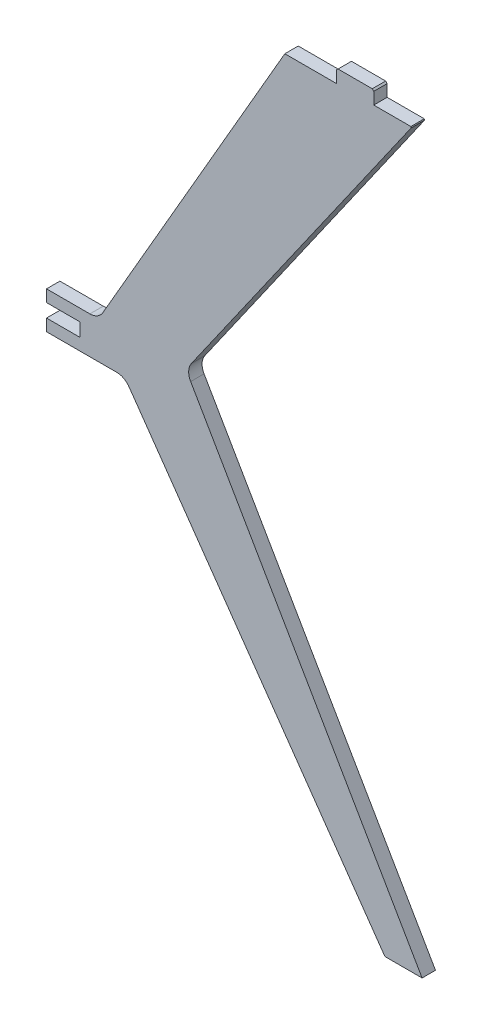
ISO-10303-21;
HEADER;
FILE_DESCRIPTION(('STEP AP214'),'2;1');
FILE_NAME('part.step','',(''),(''),'','','');
FILE_SCHEMA(('AUTOMOTIVE_DESIGN { 1 0 10303 214 1 1 1 1 }'));
ENDSEC;
DATA;
#1=APPLICATION_CONTEXT('core data for automotive mechanical design processes');
#2=APPLICATION_PROTOCOL_DEFINITION('international standard','automotive_design',2000,#1);
#3=PRODUCT_CONTEXT('',#1,'mechanical');
#4=PRODUCT('Part','Part','',(#3));
#5=PRODUCT_RELATED_PRODUCT_CATEGORY('part','',(#4));
#6=PRODUCT_DEFINITION_FORMATION('','',#4);
#7=PRODUCT_DEFINITION_CONTEXT('part definition',#1,'design');
#8=PRODUCT_DEFINITION('design','',#6,#7);
#9=PRODUCT_DEFINITION_SHAPE('','',#8);
#10=(LENGTH_UNIT() NAMED_UNIT(*) SI_UNIT(.MILLI.,.METRE.));
#11=(NAMED_UNIT(*) PLANE_ANGLE_UNIT() SI_UNIT($,.RADIAN.));
#12=(NAMED_UNIT(*) SI_UNIT($,.STERADIAN.) SOLID_ANGLE_UNIT());
#13=UNCERTAINTY_MEASURE_WITH_UNIT(LENGTH_MEASURE(1.E-05),#10,'distance_accuracy_value','');
#14=(GEOMETRIC_REPRESENTATION_CONTEXT(3) GLOBAL_UNCERTAINTY_ASSIGNED_CONTEXT((#13)) GLOBAL_UNIT_ASSIGNED_CONTEXT((#10,
#11,#12)) REPRESENTATION_CONTEXT('',''));
#15=CARTESIAN_POINT('',(0.,0.,0.));
#16=DIRECTION('',(0.,0.,1.));
#17=DIRECTION('',(1.,0.,0.));
#18=AXIS2_PLACEMENT_3D('',#15,#16,#17);
#19=CARTESIAN_POINT('',(-184.544129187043,984.,18.));
#20=DIRECTION('',(0.,-1.,0.));
#21=DIRECTION('',(0.,0.,-1.));
#22=AXIS2_PLACEMENT_3D('',#19,#20,#21);
#23=PLANE('',#22);
#24=DIRECTION('',(2.86807614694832E-13,0.,1.));
#25=VECTOR('',#24,1.);
#26=CARTESIAN_POINT('',(-115.,984.,0.));
#27=LINE('',#26,#25);
#28=CARTESIAN_POINT('',(-114.999999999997,984.,0.));
#29=VERTEX_POINT('',#28);
#30=CARTESIAN_POINT('',(-114.999999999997,984.,18.));
#31=VERTEX_POINT('',#30);
#32=EDGE_CURVE('E216',#29,#31,#27,.T.);
#33=ORIENTED_EDGE('',*,*,#32,.F.);
#34=DIRECTION('',(-1.,0.,0.));
#35=VECTOR('',#34,1.);
#36=CARTESIAN_POINT('',(-184.544129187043,984.,0.));
#37=LINE('',#36,#35);
#38=CARTESIAN_POINT('',(-184.544129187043,984.,0.));
#39=VERTEX_POINT('',#38);
#40=EDGE_CURVE('E201',#29,#39,#37,.T.);
#41=ORIENTED_EDGE('',*,*,#40,.T.);
#42=DIRECTION('',(0.,0.,-1.));
#43=VECTOR('',#42,1.);
#44=CARTESIAN_POINT('',(-184.544129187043,984.,18.));
#45=LINE('',#44,#43);
#46=CARTESIAN_POINT('',(-184.544129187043,984.,18.));
#47=VERTEX_POINT('',#46);
#48=EDGE_CURVE('E306',#47,#39,#45,.T.);
#49=ORIENTED_EDGE('',*,*,#48,.F.);
#50=DIRECTION('',(-1.,0.,0.));
#51=VECTOR('',#50,1.);
#52=CARTESIAN_POINT('',(-184.544129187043,984.,18.));
#53=LINE('',#52,#51);
#54=EDGE_CURVE('E239',#31,#47,#53,.T.);
#55=ORIENTED_EDGE('',*,*,#54,.F.);
#56=EDGE_LOOP('',(#33,#41,#49,#55));
#57=FACE_BOUND('',#56,.T.);
#58=ADVANCED_FACE('F35',(#57),#23,.F.);
#59=CARTESIAN_POINT('',(-15.0886065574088,984.,18.));
#60=VERTEX_POINT('',#59);
#61=CARTESIAN_POINT('',(-64.9999999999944,984.,18.));
#62=VERTEX_POINT('',#61);
#63=EDGE_CURVE('E240',#60,#62,#53,.T.);
#64=ORIENTED_EDGE('',*,*,#63,.F.);
#65=DIRECTION('',(0.,0.,-1.));
#66=VECTOR('',#65,1.);
#67=CARTESIAN_POINT('',(-15.0886065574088,984.,18.));
#68=LINE('',#67,#66);
#69=CARTESIAN_POINT('',(-15.0886065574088,984.,0.));
#70=VERTEX_POINT('',#69);
#71=EDGE_CURVE('E198',#60,#70,#68,.T.);
#72=ORIENTED_EDGE('',*,*,#71,.T.);
#73=CARTESIAN_POINT('',(-64.9999999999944,984.,0.));
#74=VERTEX_POINT('',#73);
#75=EDGE_CURVE('E191',#70,#74,#37,.T.);
#76=ORIENTED_EDGE('',*,*,#75,.T.);
#77=DIRECTION('',(0.,0.,-1.));
#78=VECTOR('',#77,1.);
#79=CARTESIAN_POINT('',(-64.9999999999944,984.,18.));
#80=LINE('',#79,#78);
#81=EDGE_CURVE('E196',#62,#74,#80,.T.);
#82=ORIENTED_EDGE('',*,*,#81,.F.);
#83=EDGE_LOOP('',(#64,#72,#76,#82));
#84=FACE_BOUND('',#83,.T.);
#85=ADVANCED_FACE('F194',(#84),#23,.F.);
#86=CARTESIAN_POINT('',(-50.,0.,18.));
#87=DIRECTION('',(0.,1.,0.));
#88=DIRECTION('',(0.,0.,1.));
#89=AXIS2_PLACEMENT_3D('',#86,#87,#88);
#90=PLANE('',#89);
#91=DIRECTION('',(1.,0.,0.));
#92=VECTOR('',#91,1.);
#93=CARTESIAN_POINT('',(-50.,0.,0.));
#94=LINE('',#93,#92);
#95=CARTESIAN_POINT('',(-50.,0.,0.));
#96=VERTEX_POINT('',#95);
#97=CARTESIAN_POINT('',(0.,0.,0.));
#98=VERTEX_POINT('',#97);
#99=EDGE_CURVE('E229',#96,#98,#94,.T.);
#100=ORIENTED_EDGE('',*,*,#99,.T.);
#101=DIRECTION('',(0.,0.,-1.));
#102=VECTOR('',#101,1.);
#103=CARTESIAN_POINT('',(0.,0.,18.));
#104=LINE('',#103,#102);
#105=CARTESIAN_POINT('',(0.,0.,18.));
#106=VERTEX_POINT('',#105);
#107=EDGE_CURVE('E309',#106,#98,#104,.T.);
#108=ORIENTED_EDGE('',*,*,#107,.F.);
#109=DIRECTION('',(1.,0.,0.));
#110=VECTOR('',#109,1.);
#111=CARTESIAN_POINT('',(-50.,0.,18.));
#112=LINE('',#111,#110);
#113=CARTESIAN_POINT('',(-50.,0.,18.));
#114=VERTEX_POINT('',#113);
#115=EDGE_CURVE('E230',#114,#106,#112,.T.);
#116=ORIENTED_EDGE('',*,*,#115,.F.);
#117=DIRECTION('',(0.,0.,-1.));
#118=VECTOR('',#117,1.);
#119=CARTESIAN_POINT('',(-50.,0.,18.));
#120=LINE('',#119,#118);
#121=EDGE_CURVE('E261',#114,#96,#120,.T.);
#122=ORIENTED_EDGE('',*,*,#121,.T.);
#123=EDGE_LOOP('',(#100,#108,#116,#122));
#124=FACE_BOUND('',#123,.T.);
#125=ADVANCED_FACE('F449',(#124),#90,.F.);
#126=CARTESIAN_POINT('',(0.,0.,18.));
#127=DIRECTION('',(-0.866025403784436,-0.500000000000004,0.));
#128=DIRECTION('',(0.500000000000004,-0.866025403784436,0.));
#129=AXIS2_PLACEMENT_3D('',#126,#127,#128);
#130=PLANE('',#129);
#131=DIRECTION('',(-0.500000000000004,0.866025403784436,0.));
#132=VECTOR('',#131,1.);
#133=CARTESIAN_POINT('',(0.,0.,0.));
#134=LINE('',#133,#132);
#135=CARTESIAN_POINT('',(-311.171945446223,538.965619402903,0.));
#136=VERTEX_POINT('',#135);
#137=EDGE_CURVE('E264',#98,#136,#134,.T.);
#138=ORIENTED_EDGE('',*,*,#137,.T.);
#139=DIRECTION('',(0.,0.,-1.));
#140=VECTOR('',#139,1.);
#141=CARTESIAN_POINT('',(-311.171945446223,538.965619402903,18.));
#142=LINE('',#141,#140);
#143=CARTESIAN_POINT('',(-311.171945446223,538.965619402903,18.));
#144=VERTEX_POINT('',#143);
#145=EDGE_CURVE('E340',#136,#144,#142,.F.);
#146=ORIENTED_EDGE('',*,*,#145,.T.);
#147=DIRECTION('',(-0.500000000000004,0.866025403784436,0.));
#148=VECTOR('',#147,1.);
#149=CARTESIAN_POINT('',(0.,0.,18.));
#150=LINE('',#149,#148);
#151=EDGE_CURVE('E233',#106,#144,#150,.T.);
#152=ORIENTED_EDGE('',*,*,#151,.F.);
#153=ORIENTED_EDGE('',*,*,#107,.T.);
#154=EDGE_LOOP('',(#138,#146,#152,#153));
#155=FACE_BOUND('',#154,.T.);
#156=ADVANCED_FACE('F446',(#155),#130,.F.);
#157=CARTESIAN_POINT('',(-317.542648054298,550.,18.));
#158=DIRECTION('',(-0.819152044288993,0.573576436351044,0.));
#159=DIRECTION('',(-0.573576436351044,-0.819152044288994,0.));
#160=AXIS2_PLACEMENT_3D('',#157,#158,#159);
#161=PLANE('',#160);
#162=DIRECTION('',(0.573576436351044,0.819152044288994,0.));
#163=VECTOR('',#162,1.);
#164=CARTESIAN_POINT('',(-317.542648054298,550.,18.));
#165=LINE('',#164,#163);
#166=CARTESIAN_POINT('',(-310.234478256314,560.437148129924,18.));
#167=VERTEX_POINT('',#166);
#168=CARTESIAN_POINT('',(-14.7997293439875,982.361695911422,18.));
#169=VERTEX_POINT('',#168);
#170=EDGE_CURVE('E237',#167,#169,#165,.T.);
#171=ORIENTED_EDGE('',*,*,#170,.F.);
#172=DIRECTION('',(0.,0.,-1.));
#173=VECTOR('',#172,1.);
#174=CARTESIAN_POINT('',(-310.234478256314,560.437148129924,0.));
#175=LINE('',#174,#173);
#176=CARTESIAN_POINT('',(-310.234478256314,560.437148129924,0.));
#177=VERTEX_POINT('',#176);
#178=EDGE_CURVE('E337',#167,#177,#175,.T.);
#179=ORIENTED_EDGE('',*,*,#178,.T.);
#180=DIRECTION('',(0.573576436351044,0.819152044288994,0.));
#181=VECTOR('',#180,1.);
#182=CARTESIAN_POINT('',(-317.542648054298,550.,0.));
#183=LINE('',#182,#181);
#184=CARTESIAN_POINT('',(-14.7997293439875,982.361695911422,0.));
#185=VERTEX_POINT('',#184);
#186=EDGE_CURVE('E267',#177,#185,#183,.T.);
#187=ORIENTED_EDGE('',*,*,#186,.T.);
#188=DIRECTION('',(0.,0.,1.));
#189=VECTOR('',#188,1.);
#190=CARTESIAN_POINT('',(-14.7997293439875,982.361695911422,18.));
#191=LINE('',#190,#189);
#192=EDGE_CURVE('E334',#185,#169,#191,.T.);
#193=ORIENTED_EDGE('',*,*,#192,.T.);
#194=EDGE_LOOP('',(#171,#179,#187,#193));
#195=FACE_BOUND('',#194,.T.);
#196=ADVANCED_FACE('F439',(#195),#161,.F.);
#197=CARTESIAN_POINT('',(-435.114146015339,550.,18.));
#198=DIRECTION('',(0.86602540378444,-0.499999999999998,0.));
#199=DIRECTION('',(0.499999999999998,0.86602540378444,0.));
#200=AXIS2_PLACEMENT_3D('',#197,#198,#199);
#201=PLANE('',#200);
#202=DIRECTION('',(-0.499999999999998,-0.86602540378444,0.));
#203=VECTOR('',#202,1.);
#204=CARTESIAN_POINT('',(-435.114146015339,550.,0.));
#205=LINE('',#204,#203);
#206=CARTESIAN_POINT('',(-429.340643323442,560.,0.));
#207=VERTEX_POINT('',#206);
#208=EDGE_CURVE('E200',#39,#207,#205,.T.);
#209=ORIENTED_EDGE('',*,*,#208,.T.);
#210=DIRECTION('',(0.,0.,-1.));
#211=VECTOR('',#210,1.);
#212=CARTESIAN_POINT('',(-429.340643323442,560.,18.));
#213=LINE('',#212,#211);
#214=CARTESIAN_POINT('',(-429.340643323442,560.,18.));
#215=VERTEX_POINT('',#214);
#216=EDGE_CURVE('E50',#207,#215,#213,.F.);
#217=ORIENTED_EDGE('',*,*,#216,.T.);
#218=DIRECTION('',(-0.499999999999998,-0.86602540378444,0.));
#219=VECTOR('',#218,1.);
#220=CARTESIAN_POINT('',(-435.114146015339,550.,18.));
#221=LINE('',#220,#219);
#222=EDGE_CURVE('E242',#47,#215,#221,.T.);
#223=ORIENTED_EDGE('',*,*,#222,.F.);
#224=ORIENTED_EDGE('',*,*,#48,.T.);
#225=EDGE_LOOP('',(#209,#217,#223,#224));
#226=FACE_BOUND('',#225,.T.);
#227=ADVANCED_FACE('F410',(#226),#201,.F.);
#228=CARTESIAN_POINT('',(-505.,550.,18.));
#229=DIRECTION('',(0.,-1.,0.));
#230=DIRECTION('',(0.,0.,-1.));
#231=AXIS2_PLACEMENT_3D('',#228,#229,#230);
#232=PLANE('',#231);
#233=DIRECTION('',(-1.,0.,0.));
#234=VECTOR('',#233,1.);
#235=CARTESIAN_POINT('',(-505.,550.,18.));
#236=LINE('',#235,#234);
#237=CARTESIAN_POINT('',(-446.661151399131,550.,18.));
#238=VERTEX_POINT('',#237);
#239=CARTESIAN_POINT('',(-505.,550.,18.));
#240=VERTEX_POINT('',#239);
#241=EDGE_CURVE('E244',#238,#240,#236,.T.);
#242=ORIENTED_EDGE('',*,*,#241,.F.);
#243=DIRECTION('',(0.,0.,-1.));
#244=VECTOR('',#243,1.);
#245=CARTESIAN_POINT('',(-446.661151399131,550.,0.));
#246=LINE('',#245,#244);
#247=CARTESIAN_POINT('',(-446.661151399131,550.,0.));
#248=VERTEX_POINT('',#247);
#249=EDGE_CURVE('E347',#238,#248,#246,.T.);
#250=ORIENTED_EDGE('',*,*,#249,.T.);
#251=DIRECTION('',(-1.,0.,0.));
#252=VECTOR('',#251,1.);
#253=CARTESIAN_POINT('',(-505.,550.,0.));
#254=LINE('',#253,#252);
#255=CARTESIAN_POINT('',(-505.,550.,0.));
#256=VERTEX_POINT('',#255);
#257=EDGE_CURVE('E270',#248,#256,#254,.T.);
#258=ORIENTED_EDGE('',*,*,#257,.T.);
#259=DIRECTION('',(0.,0.,-1.));
#260=VECTOR('',#259,1.);
#261=CARTESIAN_POINT('',(-505.,550.,18.));
#262=LINE('',#261,#260);
#263=EDGE_CURVE('E303',#240,#256,#262,.T.);
#264=ORIENTED_EDGE('',*,*,#263,.F.);
#265=EDGE_LOOP('',(#242,#250,#258,#264));
#266=FACE_BOUND('',#265,.T.);
#267=ADVANCED_FACE('F404',(#266),#232,.F.);
#268=CARTESIAN_POINT('',(-505.,550.,18.));
#269=DIRECTION('',(1.,0.,0.));
#270=DIRECTION('',(0.,0.,-1.));
#271=AXIS2_PLACEMENT_3D('',#268,#269,#270);
#272=PLANE('',#271);
#273=DIRECTION('',(0.,-1.,0.));
#274=VECTOR('',#273,1.);
#275=CARTESIAN_POINT('',(-505.,550.,0.));
#276=LINE('',#275,#274);
#277=CARTESIAN_POINT('',(-505.,534.,0.));
#278=VERTEX_POINT('',#277);
#279=EDGE_CURVE('E272',#256,#278,#276,.T.);
#280=ORIENTED_EDGE('',*,*,#279,.T.);
#281=DIRECTION('',(0.,0.,-1.));
#282=VECTOR('',#281,1.);
#283=CARTESIAN_POINT('',(-505.,534.,18.));
#284=LINE('',#283,#282);
#285=CARTESIAN_POINT('',(-505.,534.,18.));
#286=VERTEX_POINT('',#285);
#287=EDGE_CURVE('E300',#286,#278,#284,.T.);
#288=ORIENTED_EDGE('',*,*,#287,.F.);
#289=DIRECTION('',(0.,-1.,0.));
#290=VECTOR('',#289,1.);
#291=CARTESIAN_POINT('',(-505.,550.,18.));
#292=LINE('',#291,#290);
#293=EDGE_CURVE('E246',#240,#286,#292,.T.);
#294=ORIENTED_EDGE('',*,*,#293,.F.);
#295=ORIENTED_EDGE('',*,*,#263,.T.);
#296=EDGE_LOOP('',(#280,#288,#294,#295));
#297=FACE_BOUND('',#296,.T.);
#298=ADVANCED_FACE('F399',(#297),#272,.F.);
#299=CARTESIAN_POINT('',(-505.,534.,18.));
#300=DIRECTION('',(0.,1.,0.));
#301=DIRECTION('',(-1.,0.,0.));
#302=AXIS2_PLACEMENT_3D('',#299,#300,#301);
#303=PLANE('',#302);
#304=DIRECTION('',(1.,0.,0.));
#305=VECTOR('',#304,1.);
#306=CARTESIAN_POINT('',(-505.,534.,0.));
#307=LINE('',#306,#305);
#308=CARTESIAN_POINT('',(-460.,534.,0.));
#309=VERTEX_POINT('',#308);
#310=EDGE_CURVE('E274',#278,#309,#307,.T.);
#311=ORIENTED_EDGE('',*,*,#310,.T.);
#312=DIRECTION('',(0.,0.,-1.));
#313=VECTOR('',#312,1.);
#314=CARTESIAN_POINT('',(-460.,534.,18.));
#315=LINE('',#314,#313);
#316=CARTESIAN_POINT('',(-460.,534.,18.));
#317=VERTEX_POINT('',#316);
#318=EDGE_CURVE('E297',#317,#309,#315,.T.);
#319=ORIENTED_EDGE('',*,*,#318,.F.);
#320=DIRECTION('',(1.,0.,0.));
#321=VECTOR('',#320,1.);
#322=CARTESIAN_POINT('',(-505.,534.,18.));
#323=LINE('',#322,#321);
#324=EDGE_CURVE('E248',#286,#317,#323,.T.);
#325=ORIENTED_EDGE('',*,*,#324,.F.);
#326=ORIENTED_EDGE('',*,*,#287,.T.);
#327=EDGE_LOOP('',(#311,#319,#325,#326));
#328=FACE_BOUND('',#327,.T.);
#329=ADVANCED_FACE('F395',(#328),#303,.F.);
#330=CARTESIAN_POINT('',(-460.,534.,18.));
#331=DIRECTION('',(1.,0.,0.));
#332=DIRECTION('',(0.,1.,0.));
#333=AXIS2_PLACEMENT_3D('',#330,#331,#332);
#334=PLANE('',#333);
#335=DIRECTION('',(0.,-1.,0.));
#336=VECTOR('',#335,1.);
#337=CARTESIAN_POINT('',(-460.,534.,0.));
#338=LINE('',#337,#336);
#339=CARTESIAN_POINT('',(-460.,516.,0.));
#340=VERTEX_POINT('',#339);
#341=EDGE_CURVE('E276',#309,#340,#338,.T.);
#342=ORIENTED_EDGE('',*,*,#341,.T.);
#343=DIRECTION('',(0.,0.,-1.));
#344=VECTOR('',#343,1.);
#345=CARTESIAN_POINT('',(-460.,516.,18.));
#346=LINE('',#345,#344);
#347=CARTESIAN_POINT('',(-460.,516.,18.));
#348=VERTEX_POINT('',#347);
#349=EDGE_CURVE('E294',#348,#340,#346,.T.);
#350=ORIENTED_EDGE('',*,*,#349,.F.);
#351=DIRECTION('',(0.,-1.,0.));
#352=VECTOR('',#351,1.);
#353=CARTESIAN_POINT('',(-460.,534.,18.));
#354=LINE('',#353,#352);
#355=EDGE_CURVE('E250',#317,#348,#354,.T.);
#356=ORIENTED_EDGE('',*,*,#355,.F.);
#357=ORIENTED_EDGE('',*,*,#318,.T.);
#358=EDGE_LOOP('',(#342,#350,#356,#357));
#359=FACE_BOUND('',#358,.T.);
#360=ADVANCED_FACE('F391',(#359),#334,.F.);
#361=CARTESIAN_POINT('',(-460.,516.,18.));
#362=DIRECTION('',(0.,-1.,0.));
#363=DIRECTION('',(0.,0.,-1.));
#364=AXIS2_PLACEMENT_3D('',#361,#362,#363);
#365=PLANE('',#364);
#366=DIRECTION('',(-1.,0.,0.));
#367=VECTOR('',#366,1.);
#368=CARTESIAN_POINT('',(-460.,516.,0.));
#369=LINE('',#368,#367);
#370=CARTESIAN_POINT('',(-505.,516.,0.));
#371=VERTEX_POINT('',#370);
#372=EDGE_CURVE('E278',#340,#371,#369,.T.);
#373=ORIENTED_EDGE('',*,*,#372,.T.);
#374=DIRECTION('',(0.,0.,-1.));
#375=VECTOR('',#374,1.);
#376=CARTESIAN_POINT('',(-505.,516.,18.));
#377=LINE('',#376,#375);
#378=CARTESIAN_POINT('',(-505.,516.,18.));
#379=VERTEX_POINT('',#378);
#380=EDGE_CURVE('E291',#379,#371,#377,.T.);
#381=ORIENTED_EDGE('',*,*,#380,.F.);
#382=DIRECTION('',(-1.,0.,0.));
#383=VECTOR('',#382,1.);
#384=CARTESIAN_POINT('',(-460.,516.,18.));
#385=LINE('',#384,#383);
#386=EDGE_CURVE('E252',#348,#379,#385,.T.);
#387=ORIENTED_EDGE('',*,*,#386,.F.);
#388=ORIENTED_EDGE('',*,*,#349,.T.);
#389=EDGE_LOOP('',(#373,#381,#387,#388));
#390=FACE_BOUND('',#389,.T.);
#391=ADVANCED_FACE('F386',(#390),#365,.F.);
#392=CARTESIAN_POINT('',(-505.,516.,18.));
#393=DIRECTION('',(1.,0.,0.));
#394=DIRECTION('',(0.,0.,-1.));
#395=AXIS2_PLACEMENT_3D('',#392,#393,#394);
#396=PLANE('',#395);
#397=DIRECTION('',(0.,-1.,0.));
#398=VECTOR('',#397,1.);
#399=CARTESIAN_POINT('',(-505.,516.,0.));
#400=LINE('',#399,#398);
#401=CARTESIAN_POINT('',(-505.,500.,0.));
#402=VERTEX_POINT('',#401);
#403=EDGE_CURVE('E280',#371,#402,#400,.T.);
#404=ORIENTED_EDGE('',*,*,#403,.T.);
#405=DIRECTION('',(0.,0.,-1.));
#406=VECTOR('',#405,1.);
#407=CARTESIAN_POINT('',(-505.,500.,18.));
#408=LINE('',#407,#406);
#409=CARTESIAN_POINT('',(-505.,500.,18.));
#410=VERTEX_POINT('',#409);
#411=EDGE_CURVE('E288',#410,#402,#408,.T.);
#412=ORIENTED_EDGE('',*,*,#411,.F.);
#413=DIRECTION('',(0.,-1.,0.));
#414=VECTOR('',#413,1.);
#415=CARTESIAN_POINT('',(-505.,516.,18.));
#416=LINE('',#415,#414);
#417=EDGE_CURVE('E254',#379,#410,#416,.T.);
#418=ORIENTED_EDGE('',*,*,#417,.F.);
#419=ORIENTED_EDGE('',*,*,#380,.T.);
#420=EDGE_LOOP('',(#404,#412,#418,#419));
#421=FACE_BOUND('',#420,.T.);
#422=ADVANCED_FACE('F380',(#421),#396,.F.);
#423=CARTESIAN_POINT('',(-400.103769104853,500.,18.));
#424=DIRECTION('',(0.,1.,0.));
#425=DIRECTION('',(0.,0.,1.));
#426=AXIS2_PLACEMENT_3D('',#423,#424,#425);
#427=PLANE('',#426);
#428=DIRECTION('',(1.,0.,0.));
#429=VECTOR('',#428,1.);
#430=CARTESIAN_POINT('',(-400.103769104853,500.,0.));
#431=LINE('',#430,#429);
#432=CARTESIAN_POINT('',(-410.515110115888,500.,0.));
#433=VERTEX_POINT('',#432);
#434=EDGE_CURVE('E282',#402,#433,#431,.T.);
#435=ORIENTED_EDGE('',*,*,#434,.T.);
#436=DIRECTION('',(0.,0.,-1.));
#437=VECTOR('',#436,1.);
#438=CARTESIAN_POINT('',(-410.515110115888,500.,18.));
#439=LINE('',#438,#437);
#440=CARTESIAN_POINT('',(-410.515110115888,500.,18.));
#441=VERTEX_POINT('',#440);
#442=EDGE_CURVE('E345',#433,#441,#439,.F.);
#443=ORIENTED_EDGE('',*,*,#442,.T.);
#444=DIRECTION('',(1.,0.,0.));
#445=VECTOR('',#444,1.);
#446=CARTESIAN_POINT('',(-400.103769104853,500.,18.));
#447=LINE('',#446,#445);
#448=EDGE_CURVE('E256',#410,#441,#447,.T.);
#449=ORIENTED_EDGE('',*,*,#448,.F.);
#450=ORIENTED_EDGE('',*,*,#411,.T.);
#451=EDGE_LOOP('',(#435,#443,#449,#450));
#452=FACE_BOUND('',#451,.T.);
#453=ADVANCED_FACE('F376',(#452),#427,.F.);
#454=CARTESIAN_POINT('',(-400.103769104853,500.,18.));
#455=DIRECTION('',(0.819152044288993,0.573576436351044,0.));
#456=DIRECTION('',(-0.573576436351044,0.819152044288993,0.));
#457=AXIS2_PLACEMENT_3D('',#454,#455,#456);
#458=PLANE('',#457);
#459=DIRECTION('',(0.573576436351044,-0.819152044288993,0.));
#460=VECTOR('',#459,1.);
#461=CARTESIAN_POINT('',(-400.103769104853,500.,18.));
#462=LINE('',#461,#460);
#463=CARTESIAN_POINT('',(-394.132069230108,491.471528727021,18.));
#464=VERTEX_POINT('',#463);
#465=EDGE_CURVE('E259',#464,#114,#462,.T.);
#466=ORIENTED_EDGE('',*,*,#465,.F.);
#467=DIRECTION('',(0.,0.,-1.));
#468=VECTOR('',#467,1.);
#469=CARTESIAN_POINT('',(-394.132069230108,491.471528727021,0.));
#470=LINE('',#469,#468);
#471=CARTESIAN_POINT('',(-394.132069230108,491.471528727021,0.));
#472=VERTEX_POINT('',#471);
#473=EDGE_CURVE('E342',#464,#472,#470,.T.);
#474=ORIENTED_EDGE('',*,*,#473,.T.);
#475=DIRECTION('',(0.573576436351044,-0.819152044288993,0.));
#476=VECTOR('',#475,1.);
#477=CARTESIAN_POINT('',(-400.103769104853,500.,0.));
#478=LINE('',#477,#476);
#479=EDGE_CURVE('E234',#472,#96,#478,.T.);
#480=ORIENTED_EDGE('',*,*,#479,.T.);
#481=ORIENTED_EDGE('',*,*,#121,.F.);
#482=EDGE_LOOP('',(#466,#474,#480,#481));
#483=FACE_BOUND('',#482,.T.);
#484=ADVANCED_FACE('F368',(#483),#458,.F.);
#485=CARTESIAN_POINT('',(0.,0.,18.));
#486=DIRECTION('',(0.,0.,-1.));
#487=DIRECTION('',(-1.,0.,0.));
#488=AXIS2_PLACEMENT_3D('',#485,#486,#487);
#489=PLANE('',#488);
#490=DIRECTION('',(0.,-1.,0.));
#491=VECTOR('',#490,1.);
#492=CARTESIAN_POINT('',(-64.9999999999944,1002.,18.));
#493=LINE('',#492,#491);
#494=CARTESIAN_POINT('',(-64.9999999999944,1000.,18.));
#495=VERTEX_POINT('',#494);
#496=EDGE_CURVE('E210',#495,#62,#493,.T.);
#497=ORIENTED_EDGE('',*,*,#496,.F.);
#498=DIRECTION('',(-0.707106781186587,0.707106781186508,0.));
#499=VECTOR('',#498,1.);
#500=CARTESIAN_POINT('',(-66.9999999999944,1002.,18.));
#501=LINE('',#500,#499);
#502=CARTESIAN_POINT('',(-66.9999999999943,1002.,18.));
#503=VERTEX_POINT('',#502);
#504=EDGE_CURVE('E329',#495,#503,#501,.T.);
#505=ORIENTED_EDGE('',*,*,#504,.T.);
#506=DIRECTION('',(1.,0.,0.));
#507=VECTOR('',#506,1.);
#508=CARTESIAN_POINT('',(-114.999999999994,1002.,18.));
#509=LINE('',#508,#507);
#510=CARTESIAN_POINT('',(-112.999999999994,1002.,18.));
#511=VERTEX_POINT('',#510);
#512=EDGE_CURVE('E219',#511,#503,#509,.T.);
#513=ORIENTED_EDGE('',*,*,#512,.F.);
#514=DIRECTION('',(-0.707106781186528,-0.707106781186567,0.));
#515=VECTOR('',#514,1.);
#516=CARTESIAN_POINT('',(-112.999999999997,1002.,18.));
#517=LINE('',#516,#515);
#518=CARTESIAN_POINT('',(-114.999999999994,1000.,18.));
#519=VERTEX_POINT('',#518);
#520=EDGE_CURVE('E327',#511,#519,#517,.T.);
#521=ORIENTED_EDGE('',*,*,#520,.T.);
#522=DIRECTION('',(0.,-1.,0.));
#523=VECTOR('',#522,1.);
#524=CARTESIAN_POINT('',(-114.999999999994,1002.,18.));
#525=LINE('',#524,#523);
#526=EDGE_CURVE('E225',#519,#31,#525,.T.);
#527=ORIENTED_EDGE('',*,*,#526,.T.);
#528=ORIENTED_EDGE('',*,*,#54,.T.);
#529=ORIENTED_EDGE('',*,*,#222,.T.);
#530=CARTESIAN_POINT('',(-446.661151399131,570.,18.));
#531=DIRECTION('',(0.,0.,-1.));
#532=DIRECTION('',(-1.,0.,0.));
#533=AXIS2_PLACEMENT_3D('',#530,#531,#532);
#534=CIRCLE('',#533,20.);
#535=EDGE_CURVE('E11',#215,#238,#534,.T.);
#536=ORIENTED_EDGE('',*,*,#535,.T.);
#537=ORIENTED_EDGE('',*,*,#241,.T.);
#538=ORIENTED_EDGE('',*,*,#293,.T.);
#539=ORIENTED_EDGE('',*,*,#324,.T.);
#540=ORIENTED_EDGE('',*,*,#355,.T.);
#541=ORIENTED_EDGE('',*,*,#386,.T.);
#542=ORIENTED_EDGE('',*,*,#417,.T.);
#543=ORIENTED_EDGE('',*,*,#448,.T.);
#544=CARTESIAN_POINT('',(-410.515110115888,480.,18.));
#545=DIRECTION('',(0.,0.,-1.));
#546=DIRECTION('',(-1.,0.,0.));
#547=AXIS2_PLACEMENT_3D('',#544,#545,#546);
#548=CIRCLE('',#547,20.);
#549=EDGE_CURVE('E357',#441,#464,#548,.T.);
#550=ORIENTED_EDGE('',*,*,#549,.T.);
#551=ORIENTED_EDGE('',*,*,#465,.T.);
#552=ORIENTED_EDGE('',*,*,#115,.T.);
#553=ORIENTED_EDGE('',*,*,#151,.T.);
#554=CARTESIAN_POINT('',(-293.851437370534,548.965619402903,18.));
#555=DIRECTION('',(0.,0.,-1.));
#556=DIRECTION('',(-1.,0.,0.));
#557=AXIS2_PLACEMENT_3D('',#554,#555,#556);
#558=CIRCLE('',#557,20.);
#559=EDGE_CURVE('E353',#144,#167,#558,.T.);
#560=ORIENTED_EDGE('',*,*,#559,.T.);
#561=ORIENTED_EDGE('',*,*,#170,.T.);
#562=DIRECTION('',(0.173648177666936,-0.984807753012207,0.));
#563=VECTOR('',#562,1.);
#564=CARTESIAN_POINT('',(-15.0886065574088,984.,18.));
#565=LINE('',#564,#563);
#566=EDGE_CURVE('E325',#169,#60,#565,.F.);
#567=ORIENTED_EDGE('',*,*,#566,.T.);
#568=ORIENTED_EDGE('',*,*,#63,.T.);
#569=EDGE_LOOP('',(#497,#505,#513,#521,#527,#528,#529,#536,#537,#538,#539,#540,#541,#542,#543,
#550,#551,#552,#553,#560,#561,#567,#568));
#570=FACE_BOUND('',#569,.T.);
#571=ADVANCED_FACE('F361',(#570),#489,.F.);
#572=CARTESIAN_POINT('',(0.,0.,0.));
#573=DIRECTION('',(0.,0.,-1.));
#574=DIRECTION('',(-1.,0.,0.));
#575=AXIS2_PLACEMENT_3D('',#572,#573,#574);
#576=PLANE('',#575);
#577=DIRECTION('',(-1.,0.,0.));
#578=VECTOR('',#577,1.);
#579=CARTESIAN_POINT('',(-64.9999999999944,1002.,0.));
#580=LINE('',#579,#578);
#581=CARTESIAN_POINT('',(-66.9999999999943,1002.,0.));
#582=VERTEX_POINT('',#581);
#583=CARTESIAN_POINT('',(-112.999999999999,1002.,0.));
#584=VERTEX_POINT('',#583);
#585=EDGE_CURVE('E222',#582,#584,#580,.T.);
#586=ORIENTED_EDGE('',*,*,#585,.F.);
#587=DIRECTION('',(0.707106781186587,-0.707106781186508,0.));
#588=VECTOR('',#587,1.);
#589=CARTESIAN_POINT('',(467.500000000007,467.500000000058,0.));
#590=LINE('',#589,#588);
#591=CARTESIAN_POINT('',(-64.9999999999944,1000.,0.));
#592=VERTEX_POINT('',#591);
#593=EDGE_CURVE('E207',#582,#592,#590,.T.);
#594=ORIENTED_EDGE('',*,*,#593,.T.);
#595=DIRECTION('',(0.,-1.,0.));
#596=VECTOR('',#595,1.);
#597=CARTESIAN_POINT('',(-64.9999999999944,1002.,0.));
#598=LINE('',#597,#596);
#599=EDGE_CURVE('E204',#592,#74,#598,.T.);
#600=ORIENTED_EDGE('',*,*,#599,.T.);
#601=ORIENTED_EDGE('',*,*,#75,.F.);
#602=DIRECTION('',(-0.173648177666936,0.984807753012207,0.));
#603=VECTOR('',#602,1.);
#604=CARTESIAN_POINT('',(153.640281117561,27.0909268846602,0.));
#605=LINE('',#604,#603);
#606=EDGE_CURVE('E318',#70,#185,#605,.F.);
#607=ORIENTED_EDGE('',*,*,#606,.T.);
#608=ORIENTED_EDGE('',*,*,#186,.F.);
#609=CARTESIAN_POINT('',(-293.851437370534,548.965619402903,0.));
#610=DIRECTION('',(0.,0.,-1.));
#611=DIRECTION('',(-1.,0.,0.));
#612=AXIS2_PLACEMENT_3D('',#609,#610,#611);
#613=CIRCLE('',#612,20.);
#614=EDGE_CURVE('E351',#177,#136,#613,.F.);
#615=ORIENTED_EDGE('',*,*,#614,.T.);
#616=ORIENTED_EDGE('',*,*,#137,.F.);
#617=ORIENTED_EDGE('',*,*,#99,.F.);
#618=ORIENTED_EDGE('',*,*,#479,.F.);
#619=CARTESIAN_POINT('',(-410.515110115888,480.,0.));
#620=DIRECTION('',(0.,0.,-1.));
#621=DIRECTION('',(-1.,0.,0.));
#622=AXIS2_PLACEMENT_3D('',#619,#620,#621);
#623=CIRCLE('',#622,20.);
#624=EDGE_CURVE('E355',#472,#433,#623,.F.);
#625=ORIENTED_EDGE('',*,*,#624,.T.);
#626=ORIENTED_EDGE('',*,*,#434,.F.);
#627=ORIENTED_EDGE('',*,*,#403,.F.);
#628=ORIENTED_EDGE('',*,*,#372,.F.);
#629=ORIENTED_EDGE('',*,*,#341,.F.);
#630=ORIENTED_EDGE('',*,*,#310,.F.);
#631=ORIENTED_EDGE('',*,*,#279,.F.);
#632=ORIENTED_EDGE('',*,*,#257,.F.);
#633=CARTESIAN_POINT('',(-446.661151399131,570.,0.));
#634=DIRECTION('',(0.,0.,-1.));
#635=DIRECTION('',(-1.,0.,0.));
#636=AXIS2_PLACEMENT_3D('',#633,#634,#635);
#637=CIRCLE('',#636,20.);
#638=EDGE_CURVE('E43',#248,#207,#637,.F.);
#639=ORIENTED_EDGE('',*,*,#638,.T.);
#640=ORIENTED_EDGE('',*,*,#208,.F.);
#641=ORIENTED_EDGE('',*,*,#40,.F.);
#642=DIRECTION('',(0.,-1.,0.));
#643=VECTOR('',#642,1.);
#644=CARTESIAN_POINT('',(-115.,1002.,0.));
#645=LINE('',#644,#643);
#646=CARTESIAN_POINT('',(-115.,1000.,0.));
#647=VERTEX_POINT('',#646);
#648=EDGE_CURVE('E211',#647,#29,#645,.T.);
#649=ORIENTED_EDGE('',*,*,#648,.F.);
#650=DIRECTION('',(0.707106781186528,0.707106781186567,0.));
#651=VECTOR('',#650,1.);
#652=CARTESIAN_POINT('',(-557.500000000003,557.499999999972,0.));
#653=LINE('',#652,#651);
#654=EDGE_CURVE('E320',#647,#584,#653,.T.);
#655=ORIENTED_EDGE('',*,*,#654,.T.);
#656=EDGE_LOOP('',(#586,#594,#600,#601,#607,#608,#615,#616,#617,#618,#625,#626,#627,#628,#629,
#630,#631,#632,#639,#640,#641,#649,#655));
#657=FACE_BOUND('',#656,.T.);
#658=ADVANCED_FACE('F206',(#657),#576,.T.);
#659=CARTESIAN_POINT('',(-64.9999999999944,1002.,18.));
#660=DIRECTION('',(-1.,0.,0.));
#661=DIRECTION('',(0.,-1.,0.));
#662=AXIS2_PLACEMENT_3D('',#659,#660,#661);
#663=PLANE('',#662);
#664=ORIENTED_EDGE('',*,*,#599,.F.);
#665=DIRECTION('',(0.,0.,1.));
#666=VECTOR('',#665,1.);
#667=CARTESIAN_POINT('',(-64.9999999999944,1000.,18.));
#668=LINE('',#667,#666);
#669=EDGE_CURVE('E323',#592,#495,#668,.T.);
#670=ORIENTED_EDGE('',*,*,#669,.T.);
#671=ORIENTED_EDGE('',*,*,#496,.T.);
#672=ORIENTED_EDGE('',*,*,#81,.T.);
#673=EDGE_LOOP('',(#664,#670,#671,#672));
#674=FACE_BOUND('',#673,.T.);
#675=ADVANCED_FACE('F214',(#674),#663,.F.);
#676=CARTESIAN_POINT('',(-115.,1002.,0.));
#677=DIRECTION('',(1.,0.,-2.86807614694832E-13));
#678=DIRECTION('',(-2.86807614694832E-13,0.,-1.));
#679=AXIS2_PLACEMENT_3D('',#676,#677,#678);
#680=PLANE('',#679);
#681=ORIENTED_EDGE('',*,*,#526,.F.);
#682=DIRECTION('',(-2.86807614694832E-13,0.,-1.));
#683=VECTOR('',#682,1.);
#684=CARTESIAN_POINT('',(-115.,1000.,0.));
#685=LINE('',#684,#683);
#686=EDGE_CURVE('E331',#519,#647,#685,.T.);
#687=ORIENTED_EDGE('',*,*,#686,.T.);
#688=ORIENTED_EDGE('',*,*,#648,.T.);
#689=ORIENTED_EDGE('',*,*,#32,.T.);
#690=EDGE_LOOP('',(#681,#687,#688,#689));
#691=FACE_BOUND('',#690,.T.);
#692=ADVANCED_FACE('F418',(#691),#680,.F.);
#693=CARTESIAN_POINT('',(2.19663816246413E-12,1002.,0.));
#694=DIRECTION('',(0.,1.,0.));
#695=DIRECTION('',(-1.,0.,0.));
#696=AXIS2_PLACEMENT_3D('',#693,#694,#695);
#697=PLANE('',#696);
#698=ORIENTED_EDGE('',*,*,#512,.T.);
#699=DIRECTION('',(0.,0.,-1.));
#700=VECTOR('',#699,1.);
#701=CARTESIAN_POINT('',(-66.9999999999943,1002.,0.));
#702=LINE('',#701,#700);
#703=EDGE_CURVE('E315',#503,#582,#702,.T.);
#704=ORIENTED_EDGE('',*,*,#703,.T.);
#705=ORIENTED_EDGE('',*,*,#585,.T.);
#706=DIRECTION('',(2.86807614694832E-13,0.,1.));
#707=VECTOR('',#706,1.);
#708=CARTESIAN_POINT('',(-112.999999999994,1002.,17.9999999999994));
#709=LINE('',#708,#707);
#710=EDGE_CURVE('E312',#584,#511,#709,.T.);
#711=ORIENTED_EDGE('',*,*,#710,.T.);
#712=EDGE_LOOP('',(#698,#704,#705,#711));
#713=FACE_BOUND('',#712,.T.);
#714=ADVANCED_FACE('F426',(#713),#697,.T.);
#715=CARTESIAN_POINT('',(-66.9999999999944,1002.,0.));
#716=DIRECTION('',(0.707106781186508,0.707106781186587,0.));
#717=DIRECTION('',(0.,0.,1.));
#718=AXIS2_PLACEMENT_3D('',#715,#716,#717);
#719=PLANE('',#718);
#720=ORIENTED_EDGE('',*,*,#504,.F.);
#721=ORIENTED_EDGE('',*,*,#669,.F.);
#722=ORIENTED_EDGE('',*,*,#593,.F.);
#723=ORIENTED_EDGE('',*,*,#703,.F.);
#724=EDGE_LOOP('',(#720,#721,#722,#723));
#725=FACE_BOUND('',#724,.T.);
#726=ADVANCED_FACE('F431',(#725),#719,.T.);
#727=CARTESIAN_POINT('',(-112.999999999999,1002.,3.24092604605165E-11));
#728=DIRECTION('',(-0.707106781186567,0.707106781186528,2.0280360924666E-13));
#729=DIRECTION('',(-2.86807614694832E-13,0.,-1.));
#730=AXIS2_PLACEMENT_3D('',#727,#728,#729);
#731=PLANE('',#730);
#732=ORIENTED_EDGE('',*,*,#654,.F.);
#733=ORIENTED_EDGE('',*,*,#686,.F.);
#734=ORIENTED_EDGE('',*,*,#520,.F.);
#735=ORIENTED_EDGE('',*,*,#710,.F.);
#736=EDGE_LOOP('',(#732,#733,#734,#735));
#737=FACE_BOUND('',#736,.T.);
#738=ADVANCED_FACE('F421',(#737),#731,.T.);
#739=CARTESIAN_POINT('',(-15.0886065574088,984.,18.));
#740=DIRECTION('',(-0.984807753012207,-0.173648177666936,0.));
#741=DIRECTION('',(0.,0.,-1.));
#742=AXIS2_PLACEMENT_3D('',#739,#740,#741);
#743=PLANE('',#742);
#744=ORIENTED_EDGE('',*,*,#566,.F.);
#745=ORIENTED_EDGE('',*,*,#192,.F.);
#746=ORIENTED_EDGE('',*,*,#606,.F.);
#747=ORIENTED_EDGE('',*,*,#71,.F.);
#748=EDGE_LOOP('',(#744,#745,#746,#747));
#749=FACE_BOUND('',#748,.T.);
#750=ADVANCED_FACE('F434',(#749),#743,.F.);
#751=CARTESIAN_POINT('',(-293.851437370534,548.965619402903,18.));
#752=DIRECTION('',(0.,0.,1.));
#753=DIRECTION('',(1.,0.,0.));
#754=AXIS2_PLACEMENT_3D('',#751,#752,#753);
#755=CYLINDRICAL_SURFACE('',#754,20.);
#756=ORIENTED_EDGE('',*,*,#559,.F.);
#757=ORIENTED_EDGE('',*,*,#145,.F.);
#758=ORIENTED_EDGE('',*,*,#614,.F.);
#759=ORIENTED_EDGE('',*,*,#178,.F.);
#760=EDGE_LOOP('',(#756,#757,#758,#759));
#761=FACE_BOUND('',#760,.T.);
#762=ADVANCED_FACE('F443',(#761),#755,.F.);
#763=CARTESIAN_POINT('',(-410.515110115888,480.,18.));
#764=DIRECTION('',(0.,0.,1.));
#765=DIRECTION('',(1.,0.,0.));
#766=AXIS2_PLACEMENT_3D('',#763,#764,#765);
#767=CYLINDRICAL_SURFACE('',#766,20.);
#768=ORIENTED_EDGE('',*,*,#549,.F.);
#769=ORIENTED_EDGE('',*,*,#442,.F.);
#770=ORIENTED_EDGE('',*,*,#624,.F.);
#771=ORIENTED_EDGE('',*,*,#473,.F.);
#772=EDGE_LOOP('',(#768,#769,#770,#771));
#773=FACE_BOUND('',#772,.T.);
#774=ADVANCED_FACE('F371',(#773),#767,.F.);
#775=CARTESIAN_POINT('',(-446.661151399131,570.,18.));
#776=DIRECTION('',(0.,0.,1.));
#777=DIRECTION('',(1.,0.,0.));
#778=AXIS2_PLACEMENT_3D('',#775,#776,#777);
#779=CYLINDRICAL_SURFACE('',#778,20.);
#780=ORIENTED_EDGE('',*,*,#535,.F.);
#781=ORIENTED_EDGE('',*,*,#216,.F.);
#782=ORIENTED_EDGE('',*,*,#638,.F.);
#783=ORIENTED_EDGE('',*,*,#249,.F.);
#784=EDGE_LOOP('',(#780,#781,#782,#783));
#785=FACE_BOUND('',#784,.T.);
#786=ADVANCED_FACE('F37',(#785),#779,.F.);
#787=CLOSED_SHELL('',(#58,#85,#125,#156,#196,#227,#267,#298,#329,#360,#391,#422,#453,#484,#571,
#658,#675,#692,#714,#726,#738,#750,#762,#774,#786));
#788=MANIFOLD_SOLID_BREP('B2',#787);
#789=ADVANCED_BREP_SHAPE_REPRESENTATION('',(#18,#788),#14);
#790=SHAPE_DEFINITION_REPRESENTATION(#9,#789);
ENDSEC;
END-ISO-10303-21;
